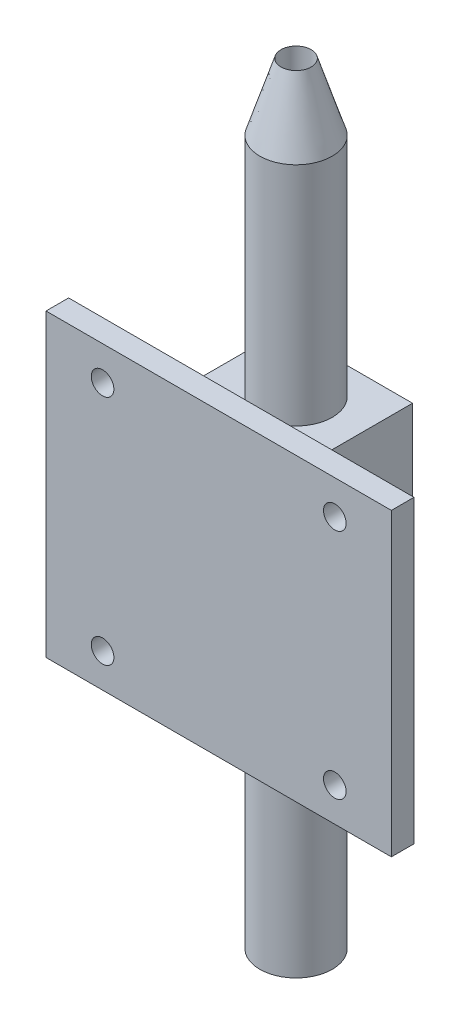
from build123d import *

# Parameters (mm, degrees)
SKETCH1_W                = 45.8
SKETCH1_H                = 39.8
SKETCH1_R                = 1.5
BOSS_EXTRUDE1_DEPTH      = 3
BOSS_EXTRUDE4_DEPTH      = 16.4
BOSS_EXTRUDE4_DEPTH_BACK = 16.4
SKETCH4_W                = 17
SKETCH4_H                = 17
SKETCH5_R                = 4.8
CUT_EXTRUDE5_DEPTH       = 46.210816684
BOSS_EXTRUDE9_DEPTH      = 30
BOSS_EXTRUDE9_DEPTH_BACK = 63.4
SKETCH8_R                = 4.8
SKETCH8_R_2              = 3.75
SKETCH11_R               = 2
CUT_EXTRUDE6_DEPTH       = 106.731498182


with BuildPart() as part:
    # Sketch1 → Boss-Extrude1 (new body)
    with BuildSketch(Plane.XY):
        Rectangle(SKETCH1_W, SKETCH1_H)
        with Locations((-15.4, 15.4)):
            Circle(SKETCH1_R, mode=Mode.SUBTRACT)
        with Locations((15.4, 15.4)):
            Circle(SKETCH1_R, mode=Mode.SUBTRACT)
        with Locations((15.4, -15.4)):
            Circle(SKETCH1_R, mode=Mode.SUBTRACT)
        with Locations((-15.4, -15.4)):
            Circle(SKETCH1_R, mode=Mode.SUBTRACT)
    extrude(amount=BOSS_EXTRUDE1_DEPTH)

    # Sketch4 → Boss-Extrude4 (add, two sides: drawn at the far end of the back side and taken through both)
    with BuildSketch(Plane(origin=(0, 0, 0), x_dir=(1, 0, 0), z_dir=(0, 1, 0)).offset(-BOSS_EXTRUDE4_DEPTH_BACK)):
        with Locations((0, 5.709783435)):
            Rectangle(SKETCH4_W, SKETCH4_H)
    extrude(amount=BOSS_EXTRUDE4_DEPTH + BOSS_EXTRUDE4_DEPTH_BACK)

    # Sketch5 → Cut-Extrude5 (cut, through all)
    with BuildSketch(Plane(origin=(0, 16.4, 0), x_dir=(1, 0, 0), z_dir=(0, 1, 0))):
        with Locations(Location((0, 7.261259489, 0), (0, 0, 270))):
            Circle(SKETCH5_R)
    extrude(amount=-CUT_EXTRUDE5_DEPTH, mode=Mode.SUBTRACT)

    # Sketch8 → Boss-Extrude9 (add, two sides: drawn at the far end of the back side and taken through both)
    with BuildSketch(Plane(origin=(0, 16.4, 0), x_dir=(1, 0, 0), z_dir=(0, 1, 0)).offset(-BOSS_EXTRUDE9_DEPTH_BACK)):
        with Locations(Location((0, 7.261259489, 0), (0, 0, 270))):
            Circle(SKETCH8_R)
        with Locations(Location((0, 7.261259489, 0), (0, 0, 270))):
            Circle(SKETCH8_R_2, mode=Mode.SUBTRACT)
    extrude(amount=BOSS_EXTRUDE9_DEPTH + BOSS_EXTRUDE9_DEPTH_BACK)

    # Sketch10 → Revolve4 (revolve)
    with BuildSketch(Plane(origin=(0, 0, 0), x_dir=(0, 0, -1), z_dir=(1, 0, 0))):
        Polygon((7.261259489, 46.4), (7.261259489, 55.239042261), (5.261259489, 55.239042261), (2.461259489, 46.4), align=None)
    revolve(axis=Axis((0, 46.4, -7.261259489), (0, 1, 0)))

    # Sketch11 → Cut-Extrude6 (cut, through all)
    with BuildSketch(Plane(origin=(0, 55.239042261, 0), x_dir=(1, 0, 0), z_dir=(0, 1, 0))):
        with Locations(Location((0, 7.261259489, 0), (0, 0, 270))):
            Circle(SKETCH11_R)
    extrude(amount=-CUT_EXTRUDE6_DEPTH, mode=Mode.SUBTRACT)


solid = part.part
